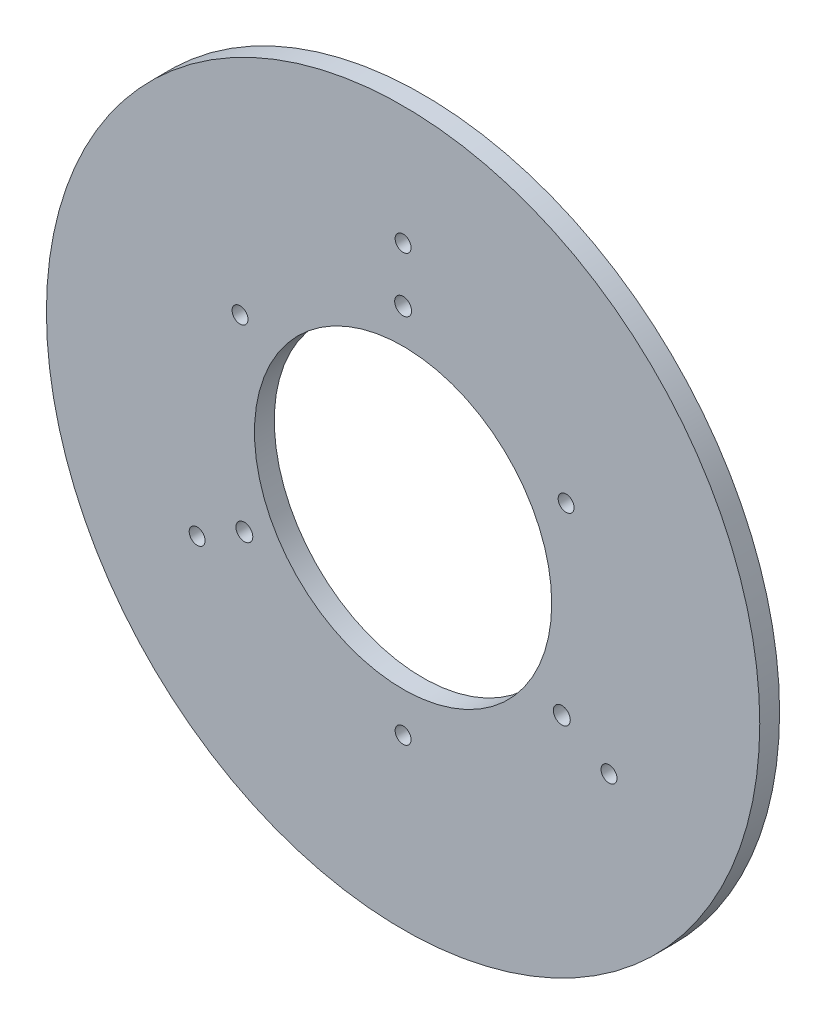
from build123d import *

# Parameters (mm, degrees)
SKETCH1_R               = 114.3
SKETCH1_R_2             = 47.625
BOSS_EXTRUDE1_DEPTH     = 6.35
F_1_4_20_TAPPED_HOLE1_D = 5.1054
F_1_4_20_TAPPED_HOLE2_D = 5.1054
F_1_4_28_TAPPED_HOLE1_D = 5.4102


with BuildPart() as part:
    # Sketch1 → Boss-Extrude1 (new body)
    with BuildSketch(Plane.XY):
        Circle(SKETCH1_R)
        Circle(SKETCH1_R_2, mode=Mode.SUBTRACT)
    extrude(amount=BOSS_EXTRUDE1_DEPTH)

    # 1_4-20 Tapped Hole1 (through all)
    with Locations(Plane.XY.offset(6.35)):
        with Locations((0, 76.2), (65.991135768, -38.1), (-65.991135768, -38.1)):
            Hole(F_1_4_20_TAPPED_HOLE1_D / 2)

    # 1_4-20 Tapped Hole2 (through all)
    with Locations(Plane.XY.offset(6.35)):
        with Locations((-52.242982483, 30.1625), (52.242982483, 30.1625), (0, -60.325)):
            Hole(F_1_4_20_TAPPED_HOLE2_D / 2)

    # 1_4-28 Tapped Hole1 (through all)
    with Locations(Plane.XY.offset(6.35)):
        with Locations((0, 58.7375), (50.868167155, -29.36875), (-50.868167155, -29.36875)):
            Hole(F_1_4_28_TAPPED_HOLE1_D / 2)


solid = part.part
